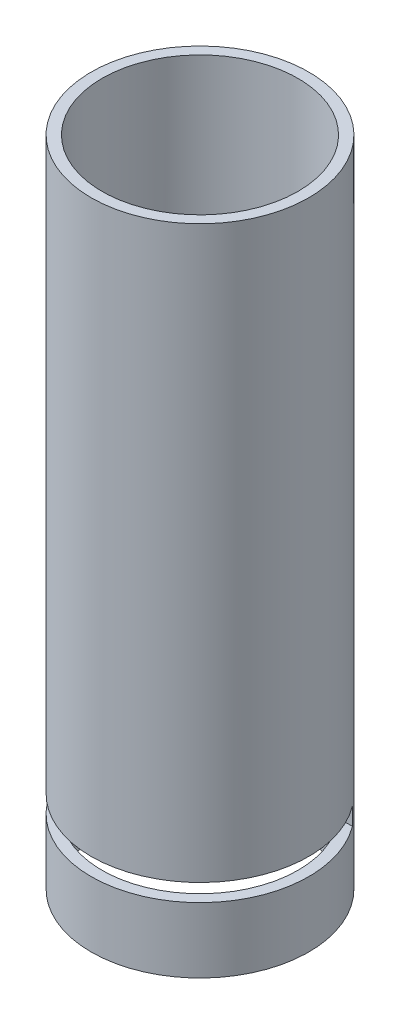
ISO-10303-21;
HEADER;
FILE_DESCRIPTION(('STEP AP214'),'2;1');
FILE_NAME('part.step','',(''),(''),'','','');
FILE_SCHEMA(('AUTOMOTIVE_DESIGN { 1 0 10303 214 1 1 1 1 }'));
ENDSEC;
DATA;
#1=APPLICATION_CONTEXT('core data for automotive mechanical design processes');
#2=APPLICATION_PROTOCOL_DEFINITION('international standard','automotive_design',2000,#1);
#3=PRODUCT_CONTEXT('',#1,'mechanical');
#4=PRODUCT('Part','Part','',(#3));
#5=PRODUCT_RELATED_PRODUCT_CATEGORY('part','',(#4));
#6=PRODUCT_DEFINITION_FORMATION('','',#4);
#7=PRODUCT_DEFINITION_CONTEXT('part definition',#1,'design');
#8=PRODUCT_DEFINITION('design','',#6,#7);
#9=PRODUCT_DEFINITION_SHAPE('','',#8);
#10=(LENGTH_UNIT() NAMED_UNIT(*) SI_UNIT(.MILLI.,.METRE.));
#11=(NAMED_UNIT(*) PLANE_ANGLE_UNIT() SI_UNIT($,.RADIAN.));
#12=(NAMED_UNIT(*) SI_UNIT($,.STERADIAN.) SOLID_ANGLE_UNIT());
#13=UNCERTAINTY_MEASURE_WITH_UNIT(LENGTH_MEASURE(1.E-05),#10,'distance_accuracy_value','');
#14=(GEOMETRIC_REPRESENTATION_CONTEXT(3) GLOBAL_UNCERTAINTY_ASSIGNED_CONTEXT((#13)) GLOBAL_UNIT_ASSIGNED_CONTEXT((#10,
#11,#12)) REPRESENTATION_CONTEXT('',''));
#15=CARTESIAN_POINT('',(0.,0.,0.));
#16=DIRECTION('',(0.,0.,1.));
#17=DIRECTION('',(1.,0.,0.));
#18=AXIS2_PLACEMENT_3D('',#15,#16,#17);
#19=CARTESIAN_POINT('',(0.,300.,0.));
#20=DIRECTION('',(0.,1.,0.));
#21=DIRECTION('',(0.,0.,1.));
#22=AXIS2_PLACEMENT_3D('',#19,#20,#21);
#23=PLANE('',#22);
#24=CARTESIAN_POINT('',(0.,300.,0.));
#25=DIRECTION('',(0.,1.,0.));
#26=DIRECTION('',(0.,0.,1.));
#27=AXIS2_PLACEMENT_3D('',#24,#25,#26);
#28=CIRCLE('',#27,50.);
#29=CARTESIAN_POINT('',(0.,300.,50.));
#30=VERTEX_POINT('',#29);
#31=EDGE_CURVE('E109',#30,#30,#28,.T.);
#32=ORIENTED_EDGE('',*,*,#31,.T.);
#33=EDGE_LOOP('',(#32));
#34=FACE_BOUND('',#33,.T.);
#35=CARTESIAN_POINT('',(0.,300.,0.));
#36=DIRECTION('',(0.,1.,0.));
#37=DIRECTION('',(1.,0.,0.));
#38=AXIS2_PLACEMENT_3D('',#35,#36,#37);
#39=CIRCLE('',#38,45.);
#40=CARTESIAN_POINT('',(45.,300.,0.));
#41=VERTEX_POINT('',#40);
#42=EDGE_CURVE('E103',#41,#41,#39,.T.);
#43=ORIENTED_EDGE('',*,*,#42,.F.);
#44=EDGE_LOOP('',(#43));
#45=FACE_BOUND('',#44,.T.);
#46=ADVANCED_FACE('F37',(#34,#45),#23,.T.);
#47=CARTESIAN_POINT('',(0.,0.,0.));
#48=DIRECTION('',(0.,1.,0.));
#49=DIRECTION('',(0.,0.,1.));
#50=AXIS2_PLACEMENT_3D('',#47,#48,#49);
#51=PLANE('',#50);
#52=CARTESIAN_POINT('',(0.,0.,0.));
#53=DIRECTION('',(0.,1.,0.));
#54=DIRECTION('',(0.,0.,1.));
#55=AXIS2_PLACEMENT_3D('',#52,#53,#54);
#56=CIRCLE('',#55,50.);
#57=CARTESIAN_POINT('',(0.,0.,50.));
#58=VERTEX_POINT('',#57);
#59=EDGE_CURVE('E106',#58,#58,#56,.T.);
#60=ORIENTED_EDGE('',*,*,#59,.F.);
#61=EDGE_LOOP('',(#60));
#62=FACE_BOUND('',#61,.T.);
#63=CARTESIAN_POINT('',(0.,0.,0.));
#64=DIRECTION('',(0.,1.,0.));
#65=DIRECTION('',(1.,0.,0.));
#66=AXIS2_PLACEMENT_3D('',#63,#64,#65);
#67=CIRCLE('',#66,45.);
#68=CARTESIAN_POINT('',(45.,0.,0.));
#69=VERTEX_POINT('',#68);
#70=EDGE_CURVE('E84',#69,#69,#67,.T.);
#71=ORIENTED_EDGE('',*,*,#70,.T.);
#72=EDGE_LOOP('',(#71));
#73=FACE_BOUND('',#72,.T.);
#74=ADVANCED_FACE('F132',(#62,#73),#51,.F.);
#75=CARTESIAN_POINT('',(0.,300.,0.));
#76=DIRECTION('',(0.,-1.,0.));
#77=DIRECTION('',(0.,0.,-1.));
#78=AXIS2_PLACEMENT_3D('',#75,#76,#77);
#79=CYLINDRICAL_SURFACE('',#78,50.);
#80=CARTESIAN_POINT('',(0.,38.,0.));
#81=DIRECTION('',(0.,1.,0.));
#82=DIRECTION('',(0.,0.,1.));
#83=AXIS2_PLACEMENT_3D('',#80,#81,#82);
#84=CIRCLE('',#83,50.);
#85=CARTESIAN_POINT('',(-40.,38.,-30.));
#86=VERTEX_POINT('',#85);
#87=CARTESIAN_POINT('',(40.,38.,-30.));
#88=VERTEX_POINT('',#87);
#89=EDGE_CURVE('E77',#86,#88,#84,.T.);
#90=ORIENTED_EDGE('',*,*,#89,.T.);
#91=DIRECTION('',(0.,-1.,0.));
#92=VECTOR('',#91,1.);
#93=CARTESIAN_POINT('',(40.,300.,-30.));
#94=LINE('',#93,#92);
#95=CARTESIAN_POINT('',(40.,30.,-30.));
#96=VERTEX_POINT('',#95);
#97=EDGE_CURVE('E80',#88,#96,#94,.T.);
#98=ORIENTED_EDGE('',*,*,#97,.T.);
#99=CARTESIAN_POINT('',(0.,30.,0.));
#100=DIRECTION('',(0.,-1.,0.));
#101=DIRECTION('',(0.,0.,-1.));
#102=AXIS2_PLACEMENT_3D('',#99,#100,#101);
#103=CIRCLE('',#102,50.);
#104=CARTESIAN_POINT('',(-40.,30.,-30.));
#105=VERTEX_POINT('',#104);
#106=EDGE_CURVE('E85',#96,#105,#103,.T.);
#107=ORIENTED_EDGE('',*,*,#106,.T.);
#108=DIRECTION('',(0.,-1.,0.));
#109=VECTOR('',#108,1.);
#110=CARTESIAN_POINT('',(-40.,300.,-30.));
#111=LINE('',#110,#109);
#112=EDGE_CURVE('E81',#105,#86,#111,.F.);
#113=ORIENTED_EDGE('',*,*,#112,.T.);
#114=EDGE_LOOP('',(#90,#98,#107,#113));
#115=FACE_BOUND('',#114,.T.);
#116=ORIENTED_EDGE('',*,*,#31,.F.);
#117=EDGE_LOOP('',(#116));
#118=FACE_BOUND('',#117,.T.);
#119=ORIENTED_EDGE('',*,*,#59,.T.);
#120=EDGE_LOOP('',(#119));
#121=FACE_BOUND('',#120,.T.);
#122=ADVANCED_FACE('F39',(#115,#118,#121),#79,.T.);
#123=CARTESIAN_POINT('',(0.,300.,0.));
#124=DIRECTION('',(0.,-1.,0.));
#125=DIRECTION('',(0.,0.,-1.));
#126=AXIS2_PLACEMENT_3D('',#123,#124,#125);
#127=CYLINDRICAL_SURFACE('',#126,45.);
#128=DIRECTION('',(0.,-1.,0.));
#129=VECTOR('',#128,1.);
#130=CARTESIAN_POINT('',(33.5410196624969,300.,-30.));
#131=LINE('',#130,#129);
#132=CARTESIAN_POINT('',(33.5410196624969,38.,-30.));
#133=VERTEX_POINT('',#132);
#134=CARTESIAN_POINT('',(33.5410196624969,30.,-30.));
#135=VERTEX_POINT('',#134);
#136=EDGE_CURVE('E12',#133,#135,#131,.T.);
#137=ORIENTED_EDGE('',*,*,#136,.F.);
#138=CARTESIAN_POINT('',(0.,38.,0.));
#139=DIRECTION('',(0.,1.,0.));
#140=DIRECTION('',(0.,0.,1.));
#141=AXIS2_PLACEMENT_3D('',#138,#139,#140);
#142=CIRCLE('',#141,45.);
#143=CARTESIAN_POINT('',(-33.5410196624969,38.,-30.));
#144=VERTEX_POINT('',#143);
#145=EDGE_CURVE('E45',#144,#133,#142,.T.);
#146=ORIENTED_EDGE('',*,*,#145,.F.);
#147=DIRECTION('',(0.,-1.,0.));
#148=VECTOR('',#147,1.);
#149=CARTESIAN_POINT('',(-33.5410196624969,300.,-30.));
#150=LINE('',#149,#148);
#151=CARTESIAN_POINT('',(-33.5410196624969,30.,-30.));
#152=VERTEX_POINT('',#151);
#153=EDGE_CURVE('E112',#152,#144,#150,.F.);
#154=ORIENTED_EDGE('',*,*,#153,.F.);
#155=CARTESIAN_POINT('',(0.,30.,0.));
#156=DIRECTION('',(0.,-1.,0.));
#157=DIRECTION('',(0.,0.,-1.));
#158=AXIS2_PLACEMENT_3D('',#155,#156,#157);
#159=CIRCLE('',#158,45.);
#160=EDGE_CURVE('E116',#135,#152,#159,.T.);
#161=ORIENTED_EDGE('',*,*,#160,.F.);
#162=EDGE_LOOP('',(#137,#146,#154,#161));
#163=FACE_BOUND('',#162,.T.);
#164=ORIENTED_EDGE('',*,*,#42,.T.);
#165=EDGE_LOOP('',(#164));
#166=FACE_BOUND('',#165,.T.);
#167=ORIENTED_EDGE('',*,*,#70,.F.);
#168=EDGE_LOOP('',(#167));
#169=FACE_BOUND('',#168,.T.);
#170=ADVANCED_FACE('F122',(#163,#166,#169),#127,.F.);
#171=CARTESIAN_POINT('',(-55.,38.,-30.));
#172=DIRECTION('',(0.,1.,0.));
#173=DIRECTION('',(0.,0.,1.));
#174=AXIS2_PLACEMENT_3D('',#171,#172,#173);
#175=PLANE('',#174);
#176=ORIENTED_EDGE('',*,*,#89,.F.);
#177=DIRECTION('',(-1.,0.,0.));
#178=VECTOR('',#177,1.);
#179=CARTESIAN_POINT('',(-55.,38.,-30.));
#180=LINE('',#179,#178);
#181=EDGE_CURVE('E52',#144,#86,#180,.T.);
#182=ORIENTED_EDGE('',*,*,#181,.F.);
#183=ORIENTED_EDGE('',*,*,#145,.T.);
#184=EDGE_CURVE('E91',#88,#133,#180,.T.);
#185=ORIENTED_EDGE('',*,*,#184,.F.);
#186=EDGE_LOOP('',(#176,#182,#183,#185));
#187=FACE_BOUND('',#186,.T.);
#188=ADVANCED_FACE('F96',(#187),#175,.F.);
#189=CARTESIAN_POINT('',(-55.,30.,-30.));
#190=DIRECTION('',(0.,-1.,0.));
#191=DIRECTION('',(0.,0.,-1.));
#192=AXIS2_PLACEMENT_3D('',#189,#190,#191);
#193=PLANE('',#192);
#194=DIRECTION('',(1.,0.,0.));
#195=VECTOR('',#194,1.);
#196=CARTESIAN_POINT('',(-55.,30.,-30.));
#197=LINE('',#196,#195);
#198=EDGE_CURVE('E94',#135,#96,#197,.T.);
#199=ORIENTED_EDGE('',*,*,#198,.F.);
#200=ORIENTED_EDGE('',*,*,#160,.T.);
#201=EDGE_CURVE('E57',#105,#152,#197,.T.);
#202=ORIENTED_EDGE('',*,*,#201,.F.);
#203=ORIENTED_EDGE('',*,*,#106,.F.);
#204=EDGE_LOOP('',(#199,#200,#202,#203));
#205=FACE_BOUND('',#204,.T.);
#206=ADVANCED_FACE('F120',(#205),#193,.F.);
#207=CARTESIAN_POINT('',(-55.,38.,-30.));
#208=DIRECTION('',(0.,0.,-1.));
#209=DIRECTION('',(-1.,0.,0.));
#210=AXIS2_PLACEMENT_3D('',#207,#208,#209);
#211=PLANE('',#210);
#212=ORIENTED_EDGE('',*,*,#184,.T.);
#213=ORIENTED_EDGE('',*,*,#136,.T.);
#214=ORIENTED_EDGE('',*,*,#198,.T.);
#215=ORIENTED_EDGE('',*,*,#97,.F.);
#216=EDGE_LOOP('',(#212,#213,#214,#215));
#217=FACE_BOUND('',#216,.T.);
#218=ADVANCED_FACE('F90',(#217),#211,.F.);
#219=ORIENTED_EDGE('',*,*,#201,.T.);
#220=ORIENTED_EDGE('',*,*,#153,.T.);
#221=ORIENTED_EDGE('',*,*,#181,.T.);
#222=ORIENTED_EDGE('',*,*,#112,.F.);
#223=EDGE_LOOP('',(#219,#220,#221,#222));
#224=FACE_BOUND('',#223,.T.);
#225=ADVANCED_FACE('F124',(#224),#211,.F.);
#226=CLOSED_SHELL('',(#46,#74,#122,#170,#188,#206,#218,#225));
#227=MANIFOLD_SOLID_BREP('B2',#226);
#228=ADVANCED_BREP_SHAPE_REPRESENTATION('',(#18,#227),#14);
#229=SHAPE_DEFINITION_REPRESENTATION(#9,#228);
ENDSEC;
END-ISO-10303-21;
